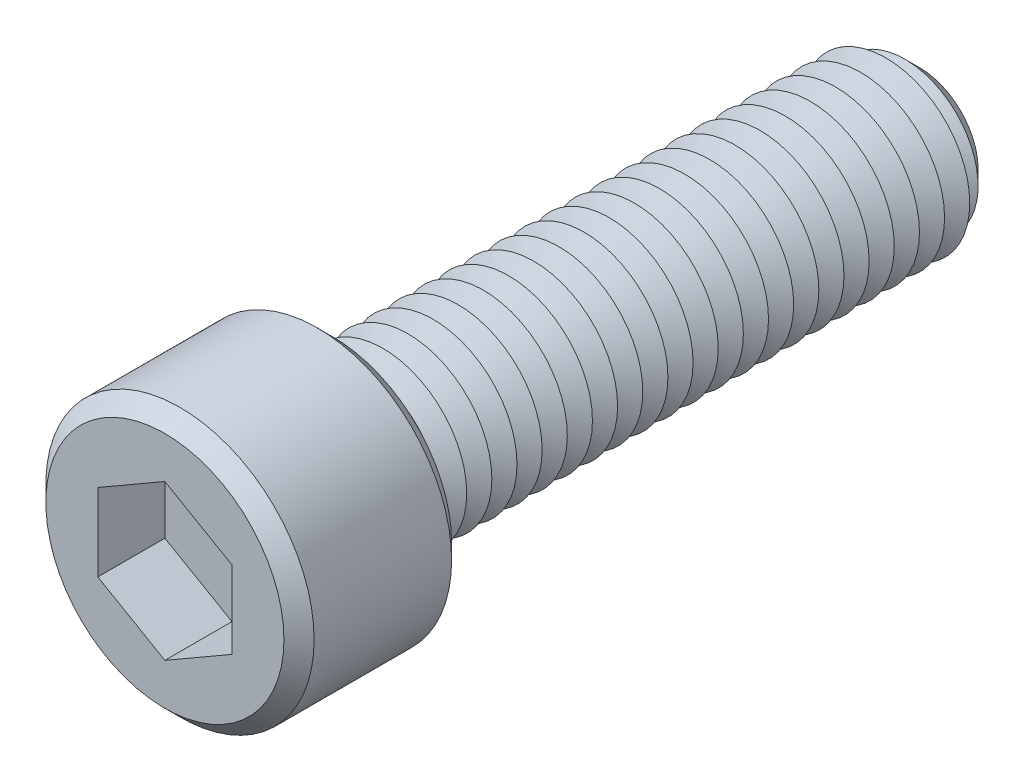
from build123d import *

# Parameters (mm, degrees)
SKETCH1_R           = 8
BOSS_EXTRUDE1_DEPTH = 10
SKETCH2_R           = 5
BOSS_EXTRUDE2_DEPTH = 35
CHAMFER1_SIZE       = 1.5
LPATTERN1_COUNT     = 23
LPATTERN1_PITCH     = 1.5
CUT_EXTRUDE1_DEPTH  = 4
SKETCH6_R           = 0.9
CUT_EXTRUDE2_DEPTH  = 41
CHAMFER2_SIZE       = 0.9


with BuildPart() as part:
    # Sketch1 → Boss-Extrude1 (new body)
    with BuildSketch(Plane.XY):
        Circle(SKETCH1_R)
    extrude(amount=BOSS_EXTRUDE1_DEPTH)

    # Sketch2 → Boss-Extrude2 (add)
    with BuildSketch(Plane(origin=(0, 0, 0), x_dir=(-1, 0, 0), z_dir=(0, 0, -1))):
        Circle(SKETCH2_R)
    extrude(amount=BOSS_EXTRUDE2_DEPTH)

    # Chamfer1
    chamfer1_edges = [part.edges().sort_by_distance(p)[0] for p in [
        (5, 0, -35),
    ]]
    chamfer(chamfer1_edges, length=CHAMFER1_SIZE)

    # Sketch4 → Cut-Revolve1 (revolve, cut)
    with BuildSketch(Plane(origin=(0, 0, 0), x_dir=(0, 0, -1), z_dir=(1, 0, 0)), mode=Mode.PRIVATE) as cut_revolve1_sk:
        Polygon((0, 5), (0.75, 3.700961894), (1.5, 5), align=None)
    cut_revolve1 = revolve(cut_revolve1_sk.sketch.rotate(Axis((0, 0, 2.512122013), (0, 0, -1)), 90), axis=Axis((0, 0, 2.512122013), (0, 0, -1)), mode=Mode.SUBTRACT)

    # LPattern1: Cut-Revolve1 ×23
    with Locations(*[(0, 0, -i * LPATTERN1_PITCH) for i in range(1, LPATTERN1_COUNT)]):
        add(cut_revolve1, mode=Mode.SUBTRACT)

    # Sketch5 → Cut-Extrude1 (cut)
    with BuildSketch(Plane.XY.offset(10)):
        Polygon((0, 4.618802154), (-4, 2.309401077), (-4, -2.309401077), (0, -4.618802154), (4, -2.309401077), (4, 2.309401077), align=None)
    extrude(amount=-CUT_EXTRUDE1_DEPTH, mode=Mode.SUBTRACT)

    # Sketch6 → Cut-Extrude2 (cut)
    with BuildSketch(Plane.XY.offset(6)):
        Circle(SKETCH6_R)
    extrude(amount=-CUT_EXTRUDE2_DEPTH, mode=Mode.SUBTRACT)

    # Chamfer2
    chamfer2_edges = [part.edges().sort_by_distance(p)[0] for p in [
        (-8, 0, 0),
        (-8, 0, 10),
    ]]
    chamfer(chamfer2_edges, length=CHAMFER2_SIZE)


solid = part.part
